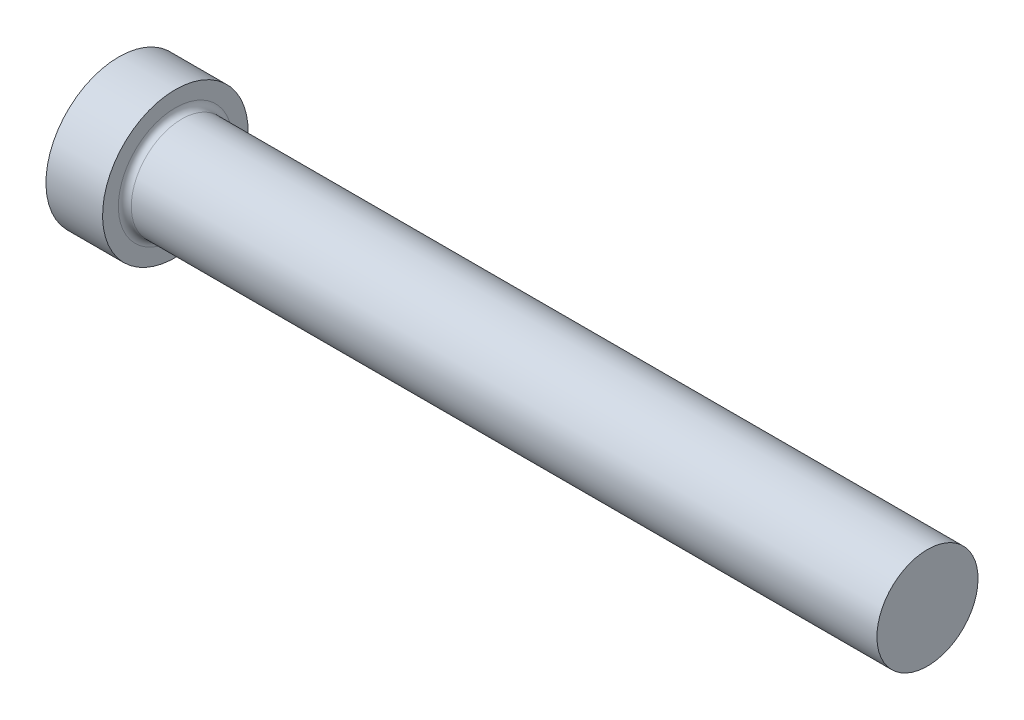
ISO-10303-21;
HEADER;
FILE_DESCRIPTION(('STEP AP214'),'2;1');
FILE_NAME('part.step','',(''),(''),'','','');
FILE_SCHEMA(('AUTOMOTIVE_DESIGN { 1 0 10303 214 1 1 1 1 }'));
ENDSEC;
DATA;
#1=APPLICATION_CONTEXT('core data for automotive mechanical design processes');
#2=APPLICATION_PROTOCOL_DEFINITION('international standard','automotive_design',2000,#1);
#3=PRODUCT_CONTEXT('',#1,'mechanical');
#4=PRODUCT('Part','Part','',(#3));
#5=PRODUCT_RELATED_PRODUCT_CATEGORY('part','',(#4));
#6=PRODUCT_DEFINITION_FORMATION('','',#4);
#7=PRODUCT_DEFINITION_CONTEXT('part definition',#1,'design');
#8=PRODUCT_DEFINITION('design','',#6,#7);
#9=PRODUCT_DEFINITION_SHAPE('','',#8);
#10=(LENGTH_UNIT() NAMED_UNIT(*) SI_UNIT(.MILLI.,.METRE.));
#11=(NAMED_UNIT(*) PLANE_ANGLE_UNIT() SI_UNIT($,.RADIAN.));
#12=(NAMED_UNIT(*) SI_UNIT($,.STERADIAN.) SOLID_ANGLE_UNIT());
#13=UNCERTAINTY_MEASURE_WITH_UNIT(LENGTH_MEASURE(1.E-05),#10,'distance_accuracy_value','');
#14=(GEOMETRIC_REPRESENTATION_CONTEXT(3) GLOBAL_UNCERTAINTY_ASSIGNED_CONTEXT((#13)) GLOBAL_UNIT_ASSIGNED_CONTEXT((#10,
#11,#12)) REPRESENTATION_CONTEXT('',''));
#15=CARTESIAN_POINT('',(0.,0.,0.));
#16=DIRECTION('',(0.,0.,1.));
#17=DIRECTION('',(1.,0.,0.));
#18=AXIS2_PLACEMENT_3D('',#15,#16,#17);
#19=CARTESIAN_POINT('',(0.,0.,0.));
#20=DIRECTION('',(-1.,0.,0.));
#21=DIRECTION('',(0.,-1.,0.));
#22=AXIS2_PLACEMENT_3D('',#19,#20,#21);
#23=PLANE('',#22);
#24=CARTESIAN_POINT('',(0.,0.,0.));
#25=DIRECTION('',(1.,0.,0.));
#26=DIRECTION('',(0.,1.,0.));
#27=AXIS2_PLACEMENT_3D('',#24,#25,#26);
#28=CIRCLE('',#27,9.);
#29=CARTESIAN_POINT('',(0.,9.,0.));
#30=VERTEX_POINT('',#29);
#31=EDGE_CURVE('E25',#30,#30,#28,.T.);
#32=ORIENTED_EDGE('',*,*,#31,.F.);
#33=EDGE_LOOP('',(#32));
#34=FACE_BOUND('',#33,.T.);
#35=ADVANCED_FACE('F14',(#34),#23,.T.);
#36=CARTESIAN_POINT('',(100.,0.,0.));
#37=DIRECTION('',(1.,0.,0.));
#38=DIRECTION('',(0.,1.,0.));
#39=AXIS2_PLACEMENT_3D('',#36,#37,#38);
#40=CYLINDRICAL_SURFACE('',#39,9.);
#41=ORIENTED_EDGE('',*,*,#31,.T.);
#42=EDGE_LOOP('',(#41));
#43=FACE_BOUND('',#42,.T.);
#44=CARTESIAN_POINT('',(7.,0.,0.));
#45=DIRECTION('',(1.,0.,0.));
#46=DIRECTION('',(0.,1.,0.));
#47=AXIS2_PLACEMENT_3D('',#44,#45,#46);
#48=CIRCLE('',#47,9.);
#49=CARTESIAN_POINT('',(7.00000000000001,8.99999999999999,0.));
#50=VERTEX_POINT('',#49);
#51=EDGE_CURVE('E29',#50,#50,#48,.T.);
#52=ORIENTED_EDGE('',*,*,#51,.F.);
#53=EDGE_LOOP('',(#52));
#54=FACE_BOUND('',#53,.T.);
#55=ADVANCED_FACE('F51',(#43,#54),#40,.T.);
#56=CARTESIAN_POINT('',(7.,9.,0.));
#57=DIRECTION('',(1.,0.,0.));
#58=DIRECTION('',(0.,1.,0.));
#59=AXIS2_PLACEMENT_3D('',#56,#57,#58);
#60=PLANE('',#59);
#61=CARTESIAN_POINT('',(7.,0.,0.));
#62=DIRECTION('',(1.,0.,0.));
#63=DIRECTION('',(0.,1.,0.));
#64=AXIS2_PLACEMENT_3D('',#61,#62,#63);
#65=CIRCLE('',#64,7.05);
#66=CARTESIAN_POINT('',(7.,7.05,0.));
#67=VERTEX_POINT('',#66);
#68=EDGE_CURVE('E9',#67,#67,#65,.F.);
#69=ORIENTED_EDGE('',*,*,#68,.T.);
#70=EDGE_LOOP('',(#69));
#71=FACE_BOUND('',#70,.T.);
#72=ORIENTED_EDGE('',*,*,#51,.T.);
#73=EDGE_LOOP('',(#72));
#74=FACE_BOUND('',#73,.T.);
#75=ADVANCED_FACE('F42',(#71,#74),#60,.T.);
#76=CARTESIAN_POINT('',(100.,0.,0.));
#77=DIRECTION('',(1.,0.,0.));
#78=DIRECTION('',(0.,1.,0.));
#79=AXIS2_PLACEMENT_3D('',#76,#77,#78);
#80=CYLINDRICAL_SURFACE('',#79,6.25);
#81=CARTESIAN_POINT('',(7.8,0.,0.));
#82=DIRECTION('',(1.,0.,0.));
#83=DIRECTION('',(0.,1.,0.));
#84=AXIS2_PLACEMENT_3D('',#81,#82,#83);
#85=CIRCLE('',#84,6.25);
#86=CARTESIAN_POINT('',(7.8,6.25,0.));
#87=VERTEX_POINT('',#86);
#88=EDGE_CURVE('E21',#87,#87,#85,.T.);
#89=ORIENTED_EDGE('',*,*,#88,.T.);
#90=EDGE_LOOP('',(#89));
#91=FACE_BOUND('',#90,.T.);
#92=CARTESIAN_POINT('',(100.,0.,0.));
#93=DIRECTION('',(1.,0.,0.));
#94=DIRECTION('',(0.,1.,0.));
#95=AXIS2_PLACEMENT_3D('',#92,#93,#94);
#96=CIRCLE('',#95,6.25);
#97=CARTESIAN_POINT('',(100.,6.24999999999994,0.));
#98=VERTEX_POINT('',#97);
#99=EDGE_CURVE('E34',#98,#98,#96,.T.);
#100=ORIENTED_EDGE('',*,*,#99,.F.);
#101=EDGE_LOOP('',(#100));
#102=FACE_BOUND('',#101,.T.);
#103=ADVANCED_FACE('F40',(#91,#102),#80,.T.);
#104=CARTESIAN_POINT('',(100.,6.24999999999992,0.));
#105=DIRECTION('',(1.,0.,0.));
#106=DIRECTION('',(0.,1.,0.));
#107=AXIS2_PLACEMENT_3D('',#104,#105,#106);
#108=PLANE('',#107);
#109=ORIENTED_EDGE('',*,*,#99,.T.);
#110=EDGE_LOOP('',(#109));
#111=FACE_BOUND('',#110,.T.);
#112=ADVANCED_FACE('F38',(#111),#108,.T.);
#113=CARTESIAN_POINT('',(7.8,0.,0.));
#114=DIRECTION('',(1.,0.,0.));
#115=DIRECTION('',(0.,1.,0.));
#116=AXIS2_PLACEMENT_3D('',#113,#114,#115);
#117=TOROIDAL_SURFACE('',#116,7.05,0.8);
#118=ORIENTED_EDGE('',*,*,#68,.F.);
#119=EDGE_LOOP('',(#118));
#120=FACE_BOUND('',#119,.T.);
#121=ORIENTED_EDGE('',*,*,#88,.F.);
#122=EDGE_LOOP('',(#121));
#123=FACE_BOUND('',#122,.T.);
#124=ADVANCED_FACE('F16',(#120,#123),#117,.F.);
#125=CLOSED_SHELL('',(#35,#55,#75,#103,#112,#124));
#126=MANIFOLD_SOLID_BREP('B1',#125);
#127=ADVANCED_BREP_SHAPE_REPRESENTATION('',(#18,#126),#14);
#128=SHAPE_DEFINITION_REPRESENTATION(#9,#127);
ENDSEC;
END-ISO-10303-21;
